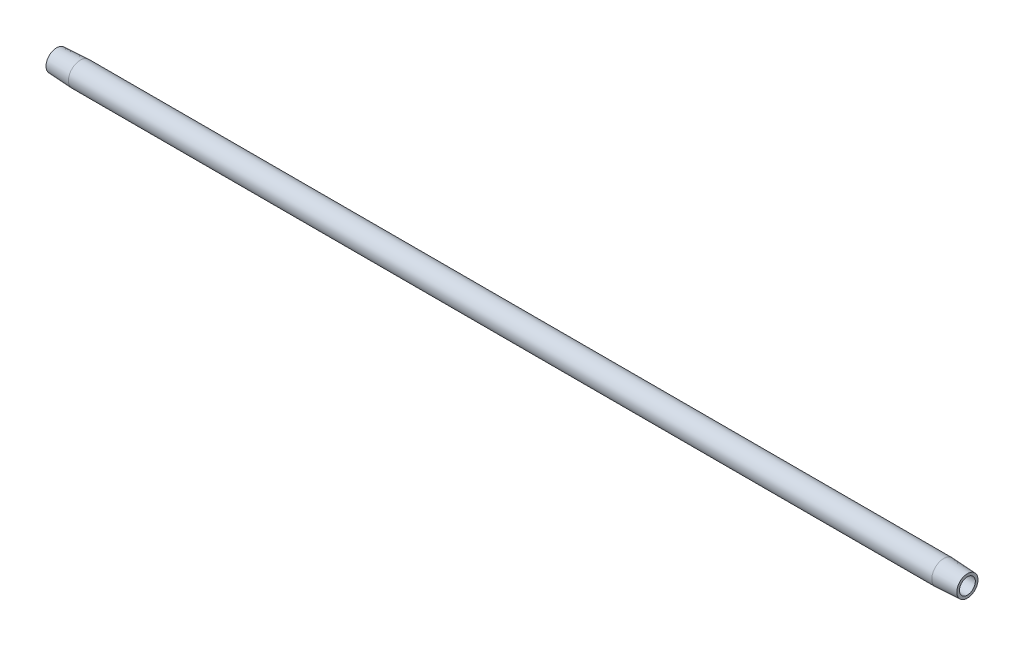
ISO-10303-21;
HEADER;
FILE_DESCRIPTION(('STEP AP214'),'2;1');
FILE_NAME('part.step','',(''),(''),'','','');
FILE_SCHEMA(('AUTOMOTIVE_DESIGN { 1 0 10303 214 1 1 1 1 }'));
ENDSEC;
DATA;
#1=APPLICATION_CONTEXT('core data for automotive mechanical design processes');
#2=APPLICATION_PROTOCOL_DEFINITION('international standard','automotive_design',2000,#1);
#3=PRODUCT_CONTEXT('',#1,'mechanical');
#4=PRODUCT('Part','Part','',(#3));
#5=PRODUCT_RELATED_PRODUCT_CATEGORY('part','',(#4));
#6=PRODUCT_DEFINITION_FORMATION('','',#4);
#7=PRODUCT_DEFINITION_CONTEXT('part definition',#1,'design');
#8=PRODUCT_DEFINITION('design','',#6,#7);
#9=PRODUCT_DEFINITION_SHAPE('','',#8);
#10=(LENGTH_UNIT() NAMED_UNIT(*) SI_UNIT(.MILLI.,.METRE.));
#11=(NAMED_UNIT(*) PLANE_ANGLE_UNIT() SI_UNIT($,.RADIAN.));
#12=(NAMED_UNIT(*) SI_UNIT($,.STERADIAN.) SOLID_ANGLE_UNIT());
#13=UNCERTAINTY_MEASURE_WITH_UNIT(LENGTH_MEASURE(1.E-05),#10,'distance_accuracy_value','');
#14=(GEOMETRIC_REPRESENTATION_CONTEXT(3) GLOBAL_UNCERTAINTY_ASSIGNED_CONTEXT((#13)) GLOBAL_UNIT_ASSIGNED_CONTEXT((#10,
#11,#12)) REPRESENTATION_CONTEXT('',''));
#15=CARTESIAN_POINT('',(0.,0.,0.));
#16=DIRECTION('',(0.,0.,1.));
#17=DIRECTION('',(1.,0.,0.));
#18=AXIS2_PLACEMENT_3D('',#15,#16,#17);
#19=CARTESIAN_POINT('',(0.476141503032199,0.,0.));
#20=DIRECTION('',(-1.,0.,0.));
#21=DIRECTION('',(0.,0.,1.));
#22=AXIS2_PLACEMENT_3D('',#19,#20,#21);
#23=CYLINDRICAL_SURFACE('',#22,3.96875);
#24=CARTESIAN_POINT('',(7.9375,0.,0.));
#25=DIRECTION('',(-1.,0.,0.));
#26=DIRECTION('',(0.,0.,1.));
#27=AXIS2_PLACEMENT_3D('',#24,#25,#26);
#28=CIRCLE('',#27,3.96875);
#29=CARTESIAN_POINT('',(7.9375,0.,3.96875));
#30=VERTEX_POINT('',#29);
#31=EDGE_CURVE('E10',#30,#30,#28,.T.);
#32=ORIENTED_EDGE('',*,*,#31,.F.);
#33=EDGE_LOOP('',(#32));
#34=FACE_BOUND('',#33,.T.);
#35=CARTESIAN_POINT('',(296.8625,0.,0.));
#36=DIRECTION('',(-1.,0.,0.));
#37=DIRECTION('',(0.,0.,1.));
#38=AXIS2_PLACEMENT_3D('',#35,#36,#37);
#39=CIRCLE('',#38,3.96875);
#40=CARTESIAN_POINT('',(296.8625,0.,3.96875));
#41=VERTEX_POINT('',#40);
#42=EDGE_CURVE('E52',#41,#41,#39,.T.);
#43=ORIENTED_EDGE('',*,*,#42,.T.);
#44=EDGE_LOOP('',(#43));
#45=FACE_BOUND('',#44,.T.);
#46=ADVANCED_FACE('F30',(#34,#45),#23,.T.);
#47=CARTESIAN_POINT('',(7.9375,0.,0.));
#48=DIRECTION('',(1.,0.,0.));
#49=DIRECTION('',(0.,0.,-1.));
#50=AXIS2_PLACEMENT_3D('',#47,#48,#49);
#51=CONICAL_SURFACE('',#50,3.96875,0.0523598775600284);
#52=CARTESIAN_POINT('',(0.,0.,0.));
#53=DIRECTION('',(-1.,0.,0.));
#54=DIRECTION('',(0.,0.,1.));
#55=AXIS2_PLACEMENT_3D('',#52,#53,#54);
#56=CIRCLE('',#55,3.55276325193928);
#57=CARTESIAN_POINT('',(0.,0.,3.55276325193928));
#58=VERTEX_POINT('',#57);
#59=EDGE_CURVE('E36',#58,#58,#56,.T.);
#60=ORIENTED_EDGE('',*,*,#59,.F.);
#61=EDGE_LOOP('',(#60));
#62=FACE_BOUND('',#61,.T.);
#63=ORIENTED_EDGE('',*,*,#31,.T.);
#64=EDGE_LOOP('',(#63));
#65=FACE_BOUND('',#64,.T.);
#66=ADVANCED_FACE('F77',(#62,#65),#51,.T.);
#67=CARTESIAN_POINT('',(0.,3.55276325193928,0.));
#68=DIRECTION('',(1.,0.,0.));
#69=DIRECTION('',(0.,0.,-1.));
#70=AXIS2_PLACEMENT_3D('',#67,#68,#69);
#71=PLANE('',#70);
#72=CARTESIAN_POINT('',(0.,0.,0.));
#73=DIRECTION('',(-1.,0.,0.));
#74=DIRECTION('',(0.,0.,1.));
#75=AXIS2_PLACEMENT_3D('',#72,#73,#74);
#76=CIRCLE('',#75,2.65429999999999);
#77=CARTESIAN_POINT('',(0.,0.,2.65429999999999));
#78=VERTEX_POINT('',#77);
#79=EDGE_CURVE('E40',#78,#78,#76,.T.);
#80=ORIENTED_EDGE('',*,*,#79,.F.);
#81=EDGE_LOOP('',(#80));
#82=FACE_BOUND('',#81,.T.);
#83=ORIENTED_EDGE('',*,*,#59,.T.);
#84=EDGE_LOOP('',(#83));
#85=FACE_BOUND('',#84,.T.);
#86=ADVANCED_FACE('F72',(#82,#85),#71,.F.);
#87=CARTESIAN_POINT('',(0.476141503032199,0.,0.));
#88=DIRECTION('',(-1.,0.,0.));
#89=DIRECTION('',(0.,0.,1.));
#90=AXIS2_PLACEMENT_3D('',#87,#88,#89);
#91=CYLINDRICAL_SURFACE('',#90,2.6543);
#92=CARTESIAN_POINT('',(304.8,0.,0.));
#93=DIRECTION('',(-1.,0.,0.));
#94=DIRECTION('',(0.,0.,1.));
#95=AXIS2_PLACEMENT_3D('',#92,#93,#94);
#96=CIRCLE('',#95,2.6543);
#97=CARTESIAN_POINT('',(304.8,0.,2.6543));
#98=VERTEX_POINT('',#97);
#99=EDGE_CURVE('E44',#98,#98,#96,.T.);
#100=ORIENTED_EDGE('',*,*,#99,.F.);
#101=EDGE_LOOP('',(#100));
#102=FACE_BOUND('',#101,.T.);
#103=ORIENTED_EDGE('',*,*,#79,.T.);
#104=EDGE_LOOP('',(#103));
#105=FACE_BOUND('',#104,.T.);
#106=ADVANCED_FACE('F66',(#102,#105),#91,.F.);
#107=CARTESIAN_POINT('',(304.8,2.6543,0.));
#108=DIRECTION('',(-1.,0.,0.));
#109=DIRECTION('',(0.,0.,1.));
#110=AXIS2_PLACEMENT_3D('',#107,#108,#109);
#111=PLANE('',#110);
#112=CARTESIAN_POINT('',(304.8,0.,0.));
#113=DIRECTION('',(-1.,0.,0.));
#114=DIRECTION('',(0.,0.,1.));
#115=AXIS2_PLACEMENT_3D('',#112,#113,#114);
#116=CIRCLE('',#115,3.55276325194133);
#117=CARTESIAN_POINT('',(304.8,0.,3.55276325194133));
#118=VERTEX_POINT('',#117);
#119=EDGE_CURVE('E49',#118,#118,#116,.T.);
#120=ORIENTED_EDGE('',*,*,#119,.F.);
#121=EDGE_LOOP('',(#120));
#122=FACE_BOUND('',#121,.T.);
#123=ORIENTED_EDGE('',*,*,#99,.T.);
#124=EDGE_LOOP('',(#123));
#125=FACE_BOUND('',#124,.T.);
#126=ADVANCED_FACE('F60',(#122,#125),#111,.F.);
#127=CARTESIAN_POINT('',(304.8,0.,0.));
#128=DIRECTION('',(-1.,0.,0.));
#129=DIRECTION('',(0.,0.,1.));
#130=AXIS2_PLACEMENT_3D('',#127,#128,#129);
#131=CONICAL_SURFACE('',#130,3.55276325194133,0.0523598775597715);
#132=ORIENTED_EDGE('',*,*,#42,.F.);
#133=EDGE_LOOP('',(#132));
#134=FACE_BOUND('',#133,.T.);
#135=ORIENTED_EDGE('',*,*,#119,.T.);
#136=EDGE_LOOP('',(#135));
#137=FACE_BOUND('',#136,.T.);
#138=ADVANCED_FACE('F57',(#134,#137),#131,.T.);
#139=CLOSED_SHELL('',(#46,#66,#86,#106,#126,#138));
#140=MANIFOLD_SOLID_BREP('B2',#139);
#141=ADVANCED_BREP_SHAPE_REPRESENTATION('',(#18,#140),#14);
#142=SHAPE_DEFINITION_REPRESENTATION(#9,#141);
ENDSEC;
END-ISO-10303-21;
